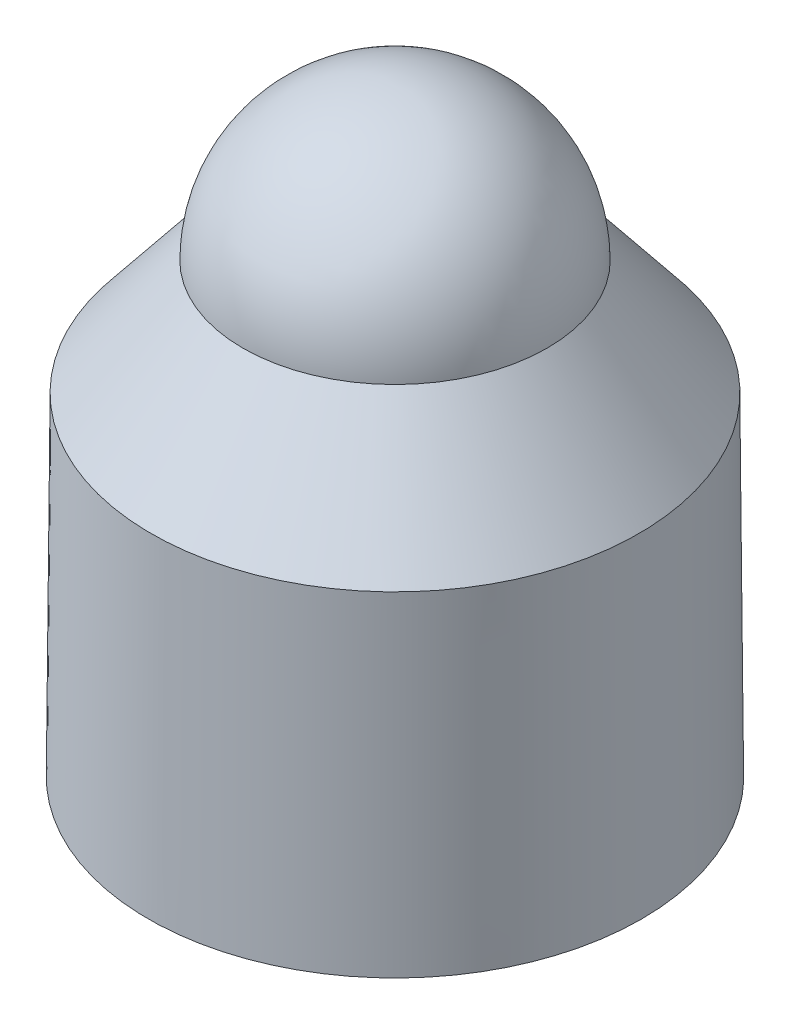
from build123d import *


with BuildPart() as part:
    # Sketch1 → Revolve1 (revolve)
    with BuildSketch(Plane.XY, mode=Mode.PRIVATE) as revolve1_sk:
        with BuildLine():
            Line((0, 50.038), (122.555, 50.038))
            Line((122.555, 50.038), (121.212859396, 215.267108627))
            Line((121.212859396, 215.267108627), (75.634851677, 272.281831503))
            ThreePointArc((75.634851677, 272.281831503), (53.356954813, 325.534900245), (0, 347.562823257))
            Line((0, 347.562823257), (0, 50.038))
        make_face()
    revolve(revolve1_sk.sketch.rotate(Axis((0, 347.562823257, 0), (0, -1, 0)), 180), axis=Axis((0, 347.562823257, 0), (0, -1, 0)))


solid = part.part
